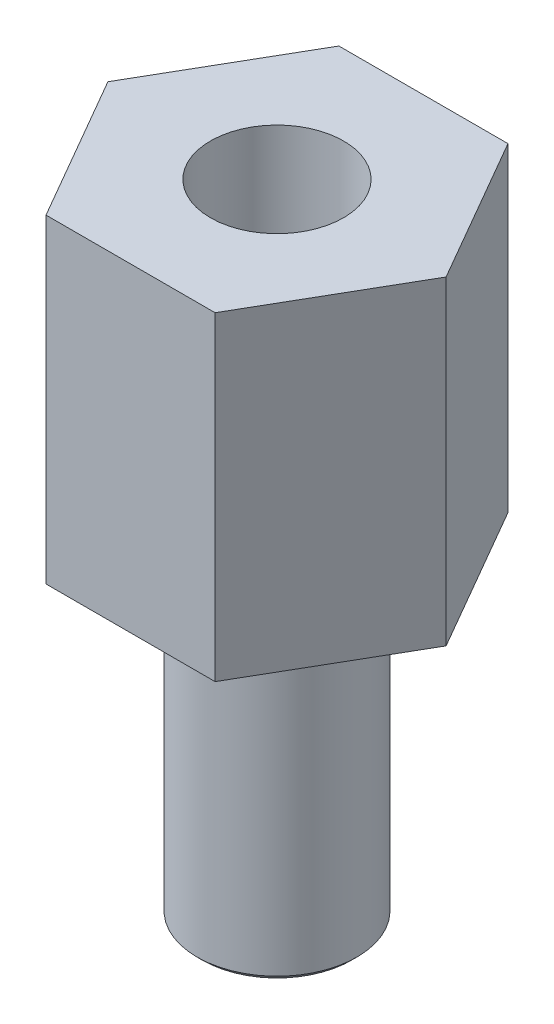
ISO-10303-21;
HEADER;
FILE_DESCRIPTION(('STEP AP214'),'2;1');
FILE_NAME('part.step','',(''),(''),'','','');
FILE_SCHEMA(('AUTOMOTIVE_DESIGN { 1 0 10303 214 1 1 1 1 }'));
ENDSEC;
DATA;
#1=APPLICATION_CONTEXT('core data for automotive mechanical design processes');
#2=APPLICATION_PROTOCOL_DEFINITION('international standard','automotive_design',2000,#1);
#3=PRODUCT_CONTEXT('',#1,'mechanical');
#4=PRODUCT('Part','Part','',(#3));
#5=PRODUCT_RELATED_PRODUCT_CATEGORY('part','',(#4));
#6=PRODUCT_DEFINITION_FORMATION('','',#4);
#7=PRODUCT_DEFINITION_CONTEXT('part definition',#1,'design');
#8=PRODUCT_DEFINITION('design','',#6,#7);
#9=PRODUCT_DEFINITION_SHAPE('','',#8);
#10=(LENGTH_UNIT() NAMED_UNIT(*) SI_UNIT(.MILLI.,.METRE.));
#11=(NAMED_UNIT(*) PLANE_ANGLE_UNIT() SI_UNIT($,.RADIAN.));
#12=(NAMED_UNIT(*) SI_UNIT($,.STERADIAN.) SOLID_ANGLE_UNIT());
#13=UNCERTAINTY_MEASURE_WITH_UNIT(LENGTH_MEASURE(1.E-05),#10,'distance_accuracy_value','');
#14=(GEOMETRIC_REPRESENTATION_CONTEXT(3) GLOBAL_UNCERTAINTY_ASSIGNED_CONTEXT((#13)) GLOBAL_UNIT_ASSIGNED_CONTEXT((#10,
#11,#12)) REPRESENTATION_CONTEXT('',''));
#15=CARTESIAN_POINT('',(0.,0.,0.));
#16=DIRECTION('',(0.,0.,1.));
#17=DIRECTION('',(1.,0.,0.));
#18=AXIS2_PLACEMENT_3D('',#15,#16,#17);
#19=CARTESIAN_POINT('',(0.,6.,0.));
#20=DIRECTION('',(0.,1.,0.));
#21=DIRECTION('',(0.,0.,1.));
#22=AXIS2_PLACEMENT_3D('',#19,#20,#21);
#23=PLANE('',#22);
#24=DIRECTION('',(0.499999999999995,0.,-0.866025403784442));
#25=VECTOR('',#24,1.);
#26=CARTESIAN_POINT('',(1.5877132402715,6.,2.74999999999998));
#27=LINE('',#26,#25);
#28=CARTESIAN_POINT('',(1.5877132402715,6.,2.74999999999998));
#29=VERTEX_POINT('',#28);
#30=CARTESIAN_POINT('',(3.17542648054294,6.,0.));
#31=VERTEX_POINT('',#30);
#32=EDGE_CURVE('E131',#29,#31,#27,.T.);
#33=ORIENTED_EDGE('',*,*,#32,.T.);
#34=DIRECTION('',(-0.500000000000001,0.,-0.866025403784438));
#35=VECTOR('',#34,1.);
#36=CARTESIAN_POINT('',(3.17542648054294,6.,0.));
#37=LINE('',#36,#35);
#38=CARTESIAN_POINT('',(1.58771324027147,6.,-2.75000000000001));
#39=VERTEX_POINT('',#38);
#40=EDGE_CURVE('E89',#31,#39,#37,.T.);
#41=ORIENTED_EDGE('',*,*,#40,.T.);
#42=DIRECTION('',(-1.,0.,0.));
#43=VECTOR('',#42,1.);
#44=CARTESIAN_POINT('',(1.58771324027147,6.,-2.75000000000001));
#45=LINE('',#44,#43);
#46=CARTESIAN_POINT('',(-1.58771324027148,6.,-2.74999999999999));
#47=VERTEX_POINT('',#46);
#48=EDGE_CURVE('E102',#39,#47,#45,.T.);
#49=ORIENTED_EDGE('',*,*,#48,.T.);
#50=DIRECTION('',(-0.499999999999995,0.,0.866025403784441));
#51=VECTOR('',#50,1.);
#52=CARTESIAN_POINT('',(-1.58771324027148,6.,-2.74999999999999));
#53=LINE('',#52,#51);
#54=CARTESIAN_POINT('',(-3.17542648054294,6.,0.));
#55=VERTEX_POINT('',#54);
#56=EDGE_CURVE('E96',#47,#55,#53,.T.);
#57=ORIENTED_EDGE('',*,*,#56,.T.);
#58=DIRECTION('',(0.500000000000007,0.,0.866025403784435));
#59=VECTOR('',#58,1.);
#60=CARTESIAN_POINT('',(-3.17542648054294,6.,0.));
#61=LINE('',#60,#59);
#62=CARTESIAN_POINT('',(-1.58771324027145,6.,2.75000000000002));
#63=VERTEX_POINT('',#62);
#64=EDGE_CURVE('E100',#55,#63,#61,.T.);
#65=ORIENTED_EDGE('',*,*,#64,.T.);
#66=DIRECTION('',(1.,0.,0.));
#67=VECTOR('',#66,1.);
#68=CARTESIAN_POINT('',(-1.58771324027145,6.,2.75000000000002));
#69=LINE('',#68,#67);
#70=EDGE_CURVE('E51',#63,#29,#69,.T.);
#71=ORIENTED_EDGE('',*,*,#70,.T.);
#72=EDGE_LOOP('',(#33,#41,#49,#57,#65,#71));
#73=FACE_BOUND('',#72,.T.);
#74=CARTESIAN_POINT('',(0.,6.,0.));
#75=DIRECTION('',(0.,1.,0.));
#76=DIRECTION('',(0.,0.,1.));
#77=AXIS2_PLACEMENT_3D('',#74,#75,#76);
#78=CIRCLE('',#77,1.25);
#79=CARTESIAN_POINT('',(0.,6.,1.25));
#80=VERTEX_POINT('',#79);
#81=EDGE_CURVE('E124',#80,#80,#78,.T.);
#82=ORIENTED_EDGE('',*,*,#81,.F.);
#83=EDGE_LOOP('',(#82));
#84=FACE_BOUND('',#83,.T.);
#85=ADVANCED_FACE('F34',(#73,#84),#23,.T.);
#86=CARTESIAN_POINT('',(0.,0.,0.));
#87=DIRECTION('',(0.,1.,0.));
#88=DIRECTION('',(0.,0.,1.));
#89=AXIS2_PLACEMENT_3D('',#86,#87,#88);
#90=PLANE('',#89);
#91=CARTESIAN_POINT('',(0.,0.,0.));
#92=DIRECTION('',(0.,1.,0.));
#93=DIRECTION('',(0.,0.,1.));
#94=AXIS2_PLACEMENT_3D('',#91,#92,#93);
#95=CIRCLE('',#94,1.5);
#96=CARTESIAN_POINT('',(0.,0.,1.5));
#97=VERTEX_POINT('',#96);
#98=EDGE_CURVE('E140',#97,#97,#95,.F.);
#99=ORIENTED_EDGE('',*,*,#98,.F.);
#100=EDGE_LOOP('',(#99));
#101=FACE_BOUND('',#100,.T.);
#102=DIRECTION('',(0.499999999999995,0.,-0.866025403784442));
#103=VECTOR('',#102,1.);
#104=CARTESIAN_POINT('',(1.5877132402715,0.,2.74999999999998));
#105=LINE('',#104,#103);
#106=CARTESIAN_POINT('',(1.5877132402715,0.,2.74999999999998));
#107=VERTEX_POINT('',#106);
#108=CARTESIAN_POINT('',(3.17542648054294,0.,0.));
#109=VERTEX_POINT('',#108);
#110=EDGE_CURVE('E120',#107,#109,#105,.T.);
#111=ORIENTED_EDGE('',*,*,#110,.F.);
#112=DIRECTION('',(1.,0.,0.));
#113=VECTOR('',#112,1.);
#114=CARTESIAN_POINT('',(-1.58771324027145,0.,2.75000000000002));
#115=LINE('',#114,#113);
#116=CARTESIAN_POINT('',(-1.58771324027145,0.,2.75000000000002));
#117=VERTEX_POINT('',#116);
#118=EDGE_CURVE('E80',#117,#107,#115,.T.);
#119=ORIENTED_EDGE('',*,*,#118,.F.);
#120=DIRECTION('',(0.500000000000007,0.,0.866025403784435));
#121=VECTOR('',#120,1.);
#122=CARTESIAN_POINT('',(-3.17542648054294,0.,0.));
#123=LINE('',#122,#121);
#124=CARTESIAN_POINT('',(-3.17542648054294,0.,0.));
#125=VERTEX_POINT('',#124);
#126=EDGE_CURVE('E74',#125,#117,#123,.T.);
#127=ORIENTED_EDGE('',*,*,#126,.F.);
#128=DIRECTION('',(-0.499999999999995,0.,0.866025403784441));
#129=VECTOR('',#128,1.);
#130=CARTESIAN_POINT('',(-1.58771324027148,0.,-2.74999999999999));
#131=LINE('',#130,#129);
#132=CARTESIAN_POINT('',(-1.58771324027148,0.,-2.74999999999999));
#133=VERTEX_POINT('',#132);
#134=EDGE_CURVE('E110',#133,#125,#131,.T.);
#135=ORIENTED_EDGE('',*,*,#134,.F.);
#136=DIRECTION('',(-1.,0.,0.));
#137=VECTOR('',#136,1.);
#138=CARTESIAN_POINT('',(1.58771324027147,0.,-2.75000000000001));
#139=LINE('',#138,#137);
#140=CARTESIAN_POINT('',(1.58771324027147,0.,-2.75000000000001));
#141=VERTEX_POINT('',#140);
#142=EDGE_CURVE('E126',#141,#133,#139,.T.);
#143=ORIENTED_EDGE('',*,*,#142,.F.);
#144=DIRECTION('',(-0.500000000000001,0.,-0.866025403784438));
#145=VECTOR('',#144,1.);
#146=CARTESIAN_POINT('',(3.17542648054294,0.,0.));
#147=LINE('',#146,#145);
#148=EDGE_CURVE('E123',#109,#141,#147,.T.);
#149=ORIENTED_EDGE('',*,*,#148,.F.);
#150=EDGE_LOOP('',(#111,#119,#127,#135,#143,#149));
#151=FACE_BOUND('',#150,.T.);
#152=ADVANCED_FACE('F156',(#101,#151),#90,.F.);
#153=CARTESIAN_POINT('',(1.5877132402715,6.,2.74999999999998));
#154=DIRECTION('',(-0.866025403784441,0.,-0.499999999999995));
#155=DIRECTION('',(-0.499999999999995,0.,0.866025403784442));
#156=AXIS2_PLACEMENT_3D('',#153,#154,#155);
#157=PLANE('',#156);
#158=ORIENTED_EDGE('',*,*,#110,.T.);
#159=DIRECTION('',(0.,-1.,0.));
#160=VECTOR('',#159,1.);
#161=CARTESIAN_POINT('',(3.17542648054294,6.,0.));
#162=LINE('',#161,#160);
#163=EDGE_CURVE('E138',#31,#109,#162,.T.);
#164=ORIENTED_EDGE('',*,*,#163,.F.);
#165=ORIENTED_EDGE('',*,*,#32,.F.);
#166=DIRECTION('',(0.,-1.,0.));
#167=VECTOR('',#166,1.);
#168=CARTESIAN_POINT('',(1.5877132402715,6.,2.74999999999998));
#169=LINE('',#168,#167);
#170=EDGE_CURVE('E116',#29,#107,#169,.T.);
#171=ORIENTED_EDGE('',*,*,#170,.T.);
#172=EDGE_LOOP('',(#158,#164,#165,#171));
#173=FACE_BOUND('',#172,.T.);
#174=ADVANCED_FACE('F161',(#173),#157,.F.);
#175=CARTESIAN_POINT('',(3.17542648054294,6.,0.));
#176=DIRECTION('',(-0.866025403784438,0.,0.500000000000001));
#177=DIRECTION('',(0.500000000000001,0.,0.866025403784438));
#178=AXIS2_PLACEMENT_3D('',#175,#176,#177);
#179=PLANE('',#178);
#180=ORIENTED_EDGE('',*,*,#148,.T.);
#181=DIRECTION('',(0.,-1.,0.));
#182=VECTOR('',#181,1.);
#183=CARTESIAN_POINT('',(1.58771324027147,6.,-2.75000000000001));
#184=LINE('',#183,#182);
#185=EDGE_CURVE('E135',#39,#141,#184,.T.);
#186=ORIENTED_EDGE('',*,*,#185,.F.);
#187=ORIENTED_EDGE('',*,*,#40,.F.);
#188=ORIENTED_EDGE('',*,*,#163,.T.);
#189=EDGE_LOOP('',(#180,#186,#187,#188));
#190=FACE_BOUND('',#189,.T.);
#191=ADVANCED_FACE('F178',(#190),#179,.F.);
#192=CARTESIAN_POINT('',(1.58771324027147,6.,-2.75000000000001));
#193=DIRECTION('',(0.,0.,1.));
#194=DIRECTION('',(1.,0.,0.));
#195=AXIS2_PLACEMENT_3D('',#192,#193,#194);
#196=PLANE('',#195);
#197=ORIENTED_EDGE('',*,*,#142,.T.);
#198=DIRECTION('',(0.,-1.,0.));
#199=VECTOR('',#198,1.);
#200=CARTESIAN_POINT('',(-1.58771324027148,6.,-2.74999999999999));
#201=LINE('',#200,#199);
#202=EDGE_CURVE('E111',#47,#133,#201,.T.);
#203=ORIENTED_EDGE('',*,*,#202,.F.);
#204=ORIENTED_EDGE('',*,*,#48,.F.);
#205=ORIENTED_EDGE('',*,*,#185,.T.);
#206=EDGE_LOOP('',(#197,#203,#204,#205));
#207=FACE_BOUND('',#206,.T.);
#208=ADVANCED_FACE('F175',(#207),#196,.F.);
#209=CARTESIAN_POINT('',(-1.58771324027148,6.,-2.74999999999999));
#210=DIRECTION('',(0.866025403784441,0.,0.499999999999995));
#211=DIRECTION('',(0.499999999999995,0.,-0.866025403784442));
#212=AXIS2_PLACEMENT_3D('',#209,#210,#211);
#213=PLANE('',#212);
#214=ORIENTED_EDGE('',*,*,#134,.T.);
#215=DIRECTION('',(0.,-1.,0.));
#216=VECTOR('',#215,1.);
#217=CARTESIAN_POINT('',(-3.17542648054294,6.,0.));
#218=LINE('',#217,#216);
#219=EDGE_CURVE('E107',#55,#125,#218,.T.);
#220=ORIENTED_EDGE('',*,*,#219,.F.);
#221=ORIENTED_EDGE('',*,*,#56,.F.);
#222=ORIENTED_EDGE('',*,*,#202,.T.);
#223=EDGE_LOOP('',(#214,#220,#221,#222));
#224=FACE_BOUND('',#223,.T.);
#225=ADVANCED_FACE('F108',(#224),#213,.F.);
#226=CARTESIAN_POINT('',(-3.17542648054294,6.,0.));
#227=DIRECTION('',(0.866025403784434,0.,-0.500000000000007));
#228=DIRECTION('',(-0.500000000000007,0.,-0.866025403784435));
#229=AXIS2_PLACEMENT_3D('',#226,#227,#228);
#230=PLANE('',#229);
#231=ORIENTED_EDGE('',*,*,#126,.T.);
#232=DIRECTION('',(0.,-1.,0.));
#233=VECTOR('',#232,1.);
#234=CARTESIAN_POINT('',(-1.58771324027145,6.,2.75000000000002));
#235=LINE('',#234,#233);
#236=EDGE_CURVE('E112',#63,#117,#235,.T.);
#237=ORIENTED_EDGE('',*,*,#236,.F.);
#238=ORIENTED_EDGE('',*,*,#64,.F.);
#239=ORIENTED_EDGE('',*,*,#219,.T.);
#240=EDGE_LOOP('',(#231,#237,#238,#239));
#241=FACE_BOUND('',#240,.T.);
#242=ADVANCED_FACE('F114',(#241),#230,.F.);
#243=CARTESIAN_POINT('',(-1.58771324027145,6.,2.75000000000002));
#244=DIRECTION('',(0.,0.,-1.));
#245=DIRECTION('',(-1.,0.,0.));
#246=AXIS2_PLACEMENT_3D('',#243,#244,#245);
#247=PLANE('',#246);
#248=ORIENTED_EDGE('',*,*,#118,.T.);
#249=ORIENTED_EDGE('',*,*,#170,.F.);
#250=ORIENTED_EDGE('',*,*,#70,.F.);
#251=ORIENTED_EDGE('',*,*,#236,.T.);
#252=EDGE_LOOP('',(#248,#249,#250,#251));
#253=FACE_BOUND('',#252,.T.);
#254=ADVANCED_FACE('F168',(#253),#247,.F.);
#255=CARTESIAN_POINT('',(0.,6.,0.));
#256=DIRECTION('',(0.,-1.,0.));
#257=DIRECTION('',(0.,0.,-1.));
#258=AXIS2_PLACEMENT_3D('',#255,#256,#257);
#259=CYLINDRICAL_SURFACE('',#258,1.25);
#260=ORIENTED_EDGE('',*,*,#81,.T.);
#261=EDGE_LOOP('',(#260));
#262=FACE_BOUND('',#261,.T.);
#263=CARTESIAN_POINT('',(0.,0.,0.));
#264=DIRECTION('',(0.,1.,0.));
#265=DIRECTION('',(0.,0.,1.));
#266=AXIS2_PLACEMENT_3D('',#263,#264,#265);
#267=CIRCLE('',#266,1.25);
#268=CARTESIAN_POINT('',(0.,0.,1.25));
#269=VERTEX_POINT('',#268);
#270=EDGE_CURVE('E193',#269,#269,#267,.T.);
#271=ORIENTED_EDGE('',*,*,#270,.F.);
#272=EDGE_LOOP('',(#271));
#273=FACE_BOUND('',#272,.T.);
#274=ADVANCED_FACE('F165',(#262,#273),#259,.F.);
#275=CARTESIAN_POINT('',(0.,0.,0.));
#276=DIRECTION('',(0.,-1.,0.));
#277=DIRECTION('',(0.,0.,-1.));
#278=AXIS2_PLACEMENT_3D('',#275,#276,#277);
#279=PLANE('',#278);
#280=ORIENTED_EDGE('',*,*,#270,.T.);
#281=EDGE_LOOP('',(#280));
#282=FACE_BOUND('',#281,.T.);
#283=ADVANCED_FACE('F201',(#282),#279,.F.);
#284=CARTESIAN_POINT('',(0.,-6.,0.));
#285=DIRECTION('',(0.,1.,0.));
#286=DIRECTION('',(0.,0.,1.));
#287=AXIS2_PLACEMENT_3D('',#284,#285,#286);
#288=CYLINDRICAL_SURFACE('',#287,1.5);
#289=CARTESIAN_POINT('',(0.,-5.9,0.));
#290=DIRECTION('',(0.,-1.,0.));
#291=DIRECTION('',(0.,0.,-1.));
#292=AXIS2_PLACEMENT_3D('',#289,#290,#291);
#293=CIRCLE('',#292,1.5);
#294=CARTESIAN_POINT('',(0.,-5.9,1.5));
#295=VERTEX_POINT('',#294);
#296=EDGE_CURVE('E11',#295,#295,#293,.F.);
#297=ORIENTED_EDGE('',*,*,#296,.T.);
#298=EDGE_LOOP('',(#297));
#299=FACE_BOUND('',#298,.T.);
#300=ORIENTED_EDGE('',*,*,#98,.T.);
#301=EDGE_LOOP('',(#300));
#302=FACE_BOUND('',#301,.T.);
#303=ADVANCED_FACE('F152',(#299,#302),#288,.T.);
#304=CARTESIAN_POINT('',(0.,-6.,0.));
#305=DIRECTION('',(0.,-1.,0.));
#306=DIRECTION('',(0.,0.,-1.));
#307=AXIS2_PLACEMENT_3D('',#304,#305,#306);
#308=PLANE('',#307);
#309=CARTESIAN_POINT('',(0.,-6.,0.));
#310=DIRECTION('',(0.,-1.,0.));
#311=DIRECTION('',(0.,0.,-1.));
#312=AXIS2_PLACEMENT_3D('',#309,#310,#311);
#313=CIRCLE('',#312,1.4);
#314=CARTESIAN_POINT('',(0.,-6.,1.4));
#315=VERTEX_POINT('',#314);
#316=EDGE_CURVE('E43',#315,#315,#313,.T.);
#317=ORIENTED_EDGE('',*,*,#316,.T.);
#318=EDGE_LOOP('',(#317));
#319=FACE_BOUND('',#318,.T.);
#320=ADVANCED_FACE('F145',(#319),#308,.T.);
#321=CARTESIAN_POINT('',(0.,-6.,0.));
#322=DIRECTION('',(0.,1.,0.));
#323=DIRECTION('',(0.,0.,1.));
#324=AXIS2_PLACEMENT_3D('',#321,#322,#323);
#325=CONICAL_SURFACE('',#324,1.4,0.785398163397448);
#326=CARTESIAN_POINT('',(0.,-5.9,1.5));
#327=CARTESIAN_POINT('',(0.,-5.90104166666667,1.49895833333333));
#328=CARTESIAN_POINT('',(0.,-5.90208333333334,1.49791666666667));
#329=CARTESIAN_POINT('',(0.,-5.90416666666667,1.49583333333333));
#330=CARTESIAN_POINT('',(0.,-5.90520833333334,1.49479166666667));
#331=CARTESIAN_POINT('',(0.,-5.90729166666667,1.49270833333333));
#332=CARTESIAN_POINT('',(0.,-5.90833333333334,1.49166666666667));
#333=CARTESIAN_POINT('',(0.,-5.91041666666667,1.48958333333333));
#334=CARTESIAN_POINT('',(0.,-5.91145833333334,1.48854166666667));
#335=CARTESIAN_POINT('',(0.,-5.91354166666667,1.48645833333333));
#336=CARTESIAN_POINT('',(0.,-5.91458333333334,1.48541666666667));
#337=CARTESIAN_POINT('',(0.,-5.91666666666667,1.48333333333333));
#338=CARTESIAN_POINT('',(0.,-5.91770833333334,1.48229166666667));
#339=CARTESIAN_POINT('',(0.,-5.91979166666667,1.48020833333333));
#340=CARTESIAN_POINT('',(0.,-5.92083333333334,1.47916666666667));
#341=CARTESIAN_POINT('',(0.,-5.92291666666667,1.47708333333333));
#342=CARTESIAN_POINT('',(0.,-5.92395833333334,1.47604166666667));
#343=CARTESIAN_POINT('',(0.,-5.92604166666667,1.47395833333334));
#344=CARTESIAN_POINT('',(0.,-5.92708333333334,1.47291666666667));
#345=CARTESIAN_POINT('',(0.,-5.92916666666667,1.47083333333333));
#346=CARTESIAN_POINT('',(0.,-5.93020833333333,1.46979166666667));
#347=CARTESIAN_POINT('',(0.,-5.93229166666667,1.46770833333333));
#348=CARTESIAN_POINT('',(0.,-5.93333333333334,1.46666666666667));
#349=CARTESIAN_POINT('',(0.,-5.93541666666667,1.46458333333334));
#350=CARTESIAN_POINT('',(0.,-5.93645833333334,1.46354166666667));
#351=CARTESIAN_POINT('',(0.,-5.93854166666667,1.46145833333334));
#352=CARTESIAN_POINT('',(0.,-5.93958333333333,1.46041666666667));
#353=CARTESIAN_POINT('',(0.,-5.94166666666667,1.45833333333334));
#354=CARTESIAN_POINT('',(0.,-5.94270833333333,1.45729166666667));
#355=CARTESIAN_POINT('',(0.,-5.94479166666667,1.45520833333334));
#356=CARTESIAN_POINT('',(0.,-5.94583333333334,1.45416666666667));
#357=CARTESIAN_POINT('',(0.,-5.94791666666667,1.45208333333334));
#358=CARTESIAN_POINT('',(0.,-5.94895833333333,1.45104166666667));
#359=CARTESIAN_POINT('',(0.,-5.95104166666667,1.44895833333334));
#360=CARTESIAN_POINT('',(0.,-5.95208333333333,1.44791666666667));
#361=CARTESIAN_POINT('',(0.,-5.95416666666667,1.44583333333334));
#362=CARTESIAN_POINT('',(0.,-5.95520833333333,1.44479166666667));
#363=CARTESIAN_POINT('',(0.,-5.95729166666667,1.44270833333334));
#364=CARTESIAN_POINT('',(0.,-5.95833333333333,1.44166666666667));
#365=CARTESIAN_POINT('',(0.,-5.96041666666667,1.43958333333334));
#366=CARTESIAN_POINT('',(0.,-5.96145833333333,1.43854166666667));
#367=CARTESIAN_POINT('',(0.,-5.96354166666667,1.43645833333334));
#368=CARTESIAN_POINT('',(0.,-5.96458333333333,1.43541666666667));
#369=CARTESIAN_POINT('',(0.,-5.96666666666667,1.43333333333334));
#370=CARTESIAN_POINT('',(0.,-5.96770833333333,1.43229166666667));
#371=CARTESIAN_POINT('',(0.,-5.96979166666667,1.43020833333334));
#372=CARTESIAN_POINT('',(0.,-5.97083333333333,1.42916666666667));
#373=CARTESIAN_POINT('',(0.,-5.97291666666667,1.42708333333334));
#374=CARTESIAN_POINT('',(0.,-5.97395833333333,1.42604166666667));
#375=CARTESIAN_POINT('',(0.,-5.97604166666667,1.42395833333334));
#376=CARTESIAN_POINT('',(0.,-5.97708333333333,1.42291666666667));
#377=CARTESIAN_POINT('',(0.,-5.97916666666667,1.42083333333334));
#378=CARTESIAN_POINT('',(0.,-5.98020833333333,1.41979166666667));
#379=CARTESIAN_POINT('',(0.,-5.98229166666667,1.41770833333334));
#380=CARTESIAN_POINT('',(0.,-5.98333333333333,1.41666666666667));
#381=CARTESIAN_POINT('',(0.,-5.98541666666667,1.41458333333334));
#382=CARTESIAN_POINT('',(0.,-5.98645833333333,1.41354166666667));
#383=CARTESIAN_POINT('',(0.,-5.98854166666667,1.41145833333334));
#384=CARTESIAN_POINT('',(0.,-5.98958333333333,1.41041666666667));
#385=CARTESIAN_POINT('',(0.,-5.99166666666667,1.40833333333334));
#386=CARTESIAN_POINT('',(0.,-5.99270833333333,1.40729166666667));
#387=CARTESIAN_POINT('',(0.,-5.99479166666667,1.40520833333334));
#388=CARTESIAN_POINT('',(0.,-5.99583333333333,1.40416666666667));
#389=CARTESIAN_POINT('',(0.,-5.99791666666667,1.40208333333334));
#390=CARTESIAN_POINT('',(0.,-5.99895833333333,1.40104166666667));
#391=CARTESIAN_POINT('',(0.,-6.,1.4));
#392=B_SPLINE_CURVE_WITH_KNOTS('',3,(#326,#327,#328,#329,#330,#331,#332,#333,#334,#335,#336,
#337,#338,#339,#340,#341,#342,#343,#344,#345,#346,#347,#348,#349,#350,#351,#352,#353,#354,#355,
#356,#357,#358,#359,#360,#361,#362,#363,#364,#365,#366,#367,#368,#369,#370,#371,#372,#373,#374,
#375,#376,#377,#378,#379,#380,#381,#382,#383,#384,#385,#386,#387,#388,#389,#390,#391),
.UNSPECIFIED.,.F.,.F.,(4,2,2,2,2,2,2,2,2,2,2,2,2,2,2,2,2,2,2,2,2,2,2,2,2,2,2,2,2,2,2,2,4),(0.,
0.00441941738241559,0.00883883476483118,0.0132582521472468,0.0176776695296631,
0.0220970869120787,0.0265165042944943,0.0309359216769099,0.0353553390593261,0.0397747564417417,
0.0441941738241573,0.0486135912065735,0.0530330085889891,0.0574524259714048,0.0618718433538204,
0.0662912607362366,0.0707106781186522,0.0751300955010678,0.079549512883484,0.0839689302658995,
0.0883883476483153,0.0928077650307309,0.0972271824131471,0.101646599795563,0.106066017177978,
0.110485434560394,0.11490485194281,0.119324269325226,0.123743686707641,0.128163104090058,
0.132582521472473,0.137001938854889,0.141421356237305),.UNSPECIFIED.);
#393=EDGE_CURVE('BSEAM36',#295,#315,#392,.T.);
#394=ORIENTED_EDGE('',*,*,#296,.F.);
#395=ORIENTED_EDGE('',*,*,#316,.F.);
#396=ORIENTED_EDGE('',*,*,#393,.T.);
#397=ORIENTED_EDGE('',*,*,#393,.F.);
#398=EDGE_LOOP('',(#394,#396,#395,#397));
#399=FACE_BOUND('',#398,.T.);
#400=ADVANCED_FACE('F36',(#399),#325,.T.);
#401=CLOSED_SHELL('',(#85,#152,#174,#191,#208,#225,#242,#254,#274,#283,#303,#320,#400));
#402=MANIFOLD_SOLID_BREP('B2',#401);
#403=ADVANCED_BREP_SHAPE_REPRESENTATION('',(#18,#402),#14);
#404=SHAPE_DEFINITION_REPRESENTATION(#9,#403);
ENDSEC;
END-ISO-10303-21;
